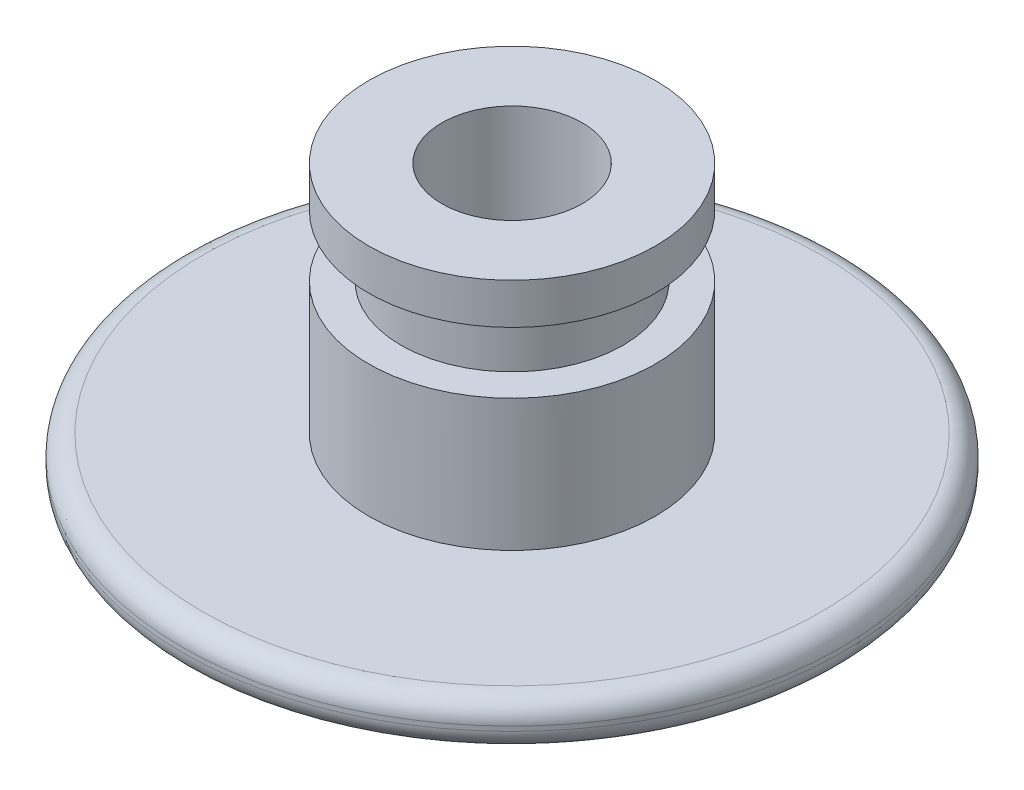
ISO-10303-21;
HEADER;
FILE_DESCRIPTION(('STEP AP214'),'2;1');
FILE_NAME('part.step','',(''),(''),'','','');
FILE_SCHEMA(('AUTOMOTIVE_DESIGN { 1 0 10303 214 1 1 1 1 }'));
ENDSEC;
DATA;
#1=APPLICATION_CONTEXT('core data for automotive mechanical design processes');
#2=APPLICATION_PROTOCOL_DEFINITION('international standard','automotive_design',2000,#1);
#3=PRODUCT_CONTEXT('',#1,'mechanical');
#4=PRODUCT('Part','Part','',(#3));
#5=PRODUCT_RELATED_PRODUCT_CATEGORY('part','',(#4));
#6=PRODUCT_DEFINITION_FORMATION('','',#4);
#7=PRODUCT_DEFINITION_CONTEXT('part definition',#1,'design');
#8=PRODUCT_DEFINITION('design','',#6,#7);
#9=PRODUCT_DEFINITION_SHAPE('','',#8);
#10=(LENGTH_UNIT() NAMED_UNIT(*) SI_UNIT(.MILLI.,.METRE.));
#11=(NAMED_UNIT(*) PLANE_ANGLE_UNIT() SI_UNIT($,.RADIAN.));
#12=(NAMED_UNIT(*) SI_UNIT($,.STERADIAN.) SOLID_ANGLE_UNIT());
#13=UNCERTAINTY_MEASURE_WITH_UNIT(LENGTH_MEASURE(1.E-05),#10,'distance_accuracy_value','');
#14=(GEOMETRIC_REPRESENTATION_CONTEXT(3) GLOBAL_UNCERTAINTY_ASSIGNED_CONTEXT((#13)) GLOBAL_UNIT_ASSIGNED_CONTEXT((#10,
#11,#12)) REPRESENTATION_CONTEXT('',''));
#15=CARTESIAN_POINT('',(0.,0.,0.));
#16=DIRECTION('',(0.,0.,1.));
#17=DIRECTION('',(1.,0.,0.));
#18=AXIS2_PLACEMENT_3D('',#15,#16,#17);
#19=CARTESIAN_POINT('',(0.,10.7696,0.));
#20=DIRECTION('',(0.,-1.,0.));
#21=DIRECTION('',(0.,0.,-1.));
#22=AXIS2_PLACEMENT_3D('',#19,#20,#21);
#23=CYLINDRICAL_SURFACE('',#22,5.5245);
#24=CARTESIAN_POINT('',(0.,10.7696,0.));
#25=DIRECTION('',(0.,1.,0.));
#26=DIRECTION('',(0.,0.,1.));
#27=AXIS2_PLACEMENT_3D('',#24,#25,#26);
#28=CIRCLE('',#27,5.5245);
#29=CARTESIAN_POINT('',(0.,10.7696,5.5245));
#30=VERTEX_POINT('',#29);
#31=EDGE_CURVE('E64',#30,#30,#28,.T.);
#32=ORIENTED_EDGE('',*,*,#31,.F.);
#33=EDGE_LOOP('',(#32));
#34=FACE_BOUND('',#33,.T.);
#35=CARTESIAN_POINT('',(0.,9.1948,0.));
#36=DIRECTION('',(0.,-1.,0.));
#37=DIRECTION('',(0.,0.,-1.));
#38=AXIS2_PLACEMENT_3D('',#35,#36,#37);
#39=CIRCLE('',#38,5.5245);
#40=CARTESIAN_POINT('',(0.,9.1948,-5.5245));
#41=VERTEX_POINT('',#40);
#42=EDGE_CURVE('E54',#41,#41,#39,.T.);
#43=ORIENTED_EDGE('',*,*,#42,.F.);
#44=EDGE_LOOP('',(#43));
#45=FACE_BOUND('',#44,.T.);
#46=ADVANCED_FACE('F33',(#34,#45),#23,.T.);
#47=CARTESIAN_POINT('',(0.,1.7526,0.));
#48=DIRECTION('',(0.,1.,0.));
#49=DIRECTION('',(0.,0.,1.));
#50=AXIS2_PLACEMENT_3D('',#47,#48,#49);
#51=PLANE('',#50);
#52=CARTESIAN_POINT('',(0.,1.7526,0.));
#53=DIRECTION('',(0.,1.,0.));
#54=DIRECTION('',(0.,0.,1.));
#55=AXIS2_PLACEMENT_3D('',#52,#53,#54);
#56=CIRCLE('',#55,11.9126);
#57=CARTESIAN_POINT('',(0.,1.7526,11.9126));
#58=VERTEX_POINT('',#57);
#59=EDGE_CURVE('E48',#58,#58,#56,.T.);
#60=ORIENTED_EDGE('',*,*,#59,.T.);
#61=EDGE_LOOP('',(#60));
#62=FACE_BOUND('',#61,.T.);
#63=CARTESIAN_POINT('',(0.,1.7526,0.));
#64=DIRECTION('',(0.,1.,0.));
#65=DIRECTION('',(0.,0.,1.));
#66=AXIS2_PLACEMENT_3D('',#63,#64,#65);
#67=CIRCLE('',#66,5.5245);
#68=CARTESIAN_POINT('',(0.,1.7526,5.5245));
#69=VERTEX_POINT('',#68);
#70=EDGE_CURVE('E67',#69,#69,#67,.T.);
#71=ORIENTED_EDGE('',*,*,#70,.F.);
#72=EDGE_LOOP('',(#71));
#73=FACE_BOUND('',#72,.T.);
#74=ADVANCED_FACE('F102',(#62,#73),#51,.T.);
#75=CARTESIAN_POINT('',(0.,1.7526,0.));
#76=DIRECTION('',(0.,-1.,0.));
#77=DIRECTION('',(0.,0.,-1.));
#78=AXIS2_PLACEMENT_3D('',#75,#76,#77);
#79=CYLINDRICAL_SURFACE('',#78,12.7);
#80=CARTESIAN_POINT('',(0.,0.9652,0.));
#81=DIRECTION('',(0.,1.,0.));
#82=DIRECTION('',(0.,0.,1.));
#83=AXIS2_PLACEMENT_3D('',#80,#81,#82);
#84=CIRCLE('',#83,12.7);
#85=CARTESIAN_POINT('',(0.,0.9652,12.7));
#86=VERTEX_POINT('',#85);
#87=EDGE_CURVE('E40',#86,#86,#84,.F.);
#88=ORIENTED_EDGE('',*,*,#87,.T.);
#89=EDGE_LOOP('',(#88));
#90=FACE_BOUND('',#89,.T.);
#91=CARTESIAN_POINT('',(0.,0.7874,0.));
#92=DIRECTION('',(0.,1.,0.));
#93=DIRECTION('',(0.,0.,1.));
#94=AXIS2_PLACEMENT_3D('',#91,#92,#93);
#95=CIRCLE('',#94,12.7);
#96=CARTESIAN_POINT('',(0.,0.7874,12.7));
#97=VERTEX_POINT('',#96);
#98=EDGE_CURVE('E44',#97,#97,#95,.T.);
#99=ORIENTED_EDGE('',*,*,#98,.T.);
#100=EDGE_LOOP('',(#99));
#101=FACE_BOUND('',#100,.T.);
#102=ADVANCED_FACE('F35',(#90,#101),#79,.T.);
#103=CARTESIAN_POINT('',(0.,0.,0.));
#104=DIRECTION('',(0.,1.,0.));
#105=DIRECTION('',(0.,0.,1.));
#106=AXIS2_PLACEMENT_3D('',#103,#104,#105);
#107=PLANE('',#106);
#108=CARTESIAN_POINT('',(0.,0.,0.));
#109=DIRECTION('',(0.,1.,0.));
#110=DIRECTION('',(0.,0.,1.));
#111=AXIS2_PLACEMENT_3D('',#108,#109,#110);
#112=CIRCLE('',#111,11.9126);
#113=CARTESIAN_POINT('',(0.,0.,11.9126));
#114=VERTEX_POINT('',#113);
#115=EDGE_CURVE('E11',#114,#114,#112,.F.);
#116=ORIENTED_EDGE('',*,*,#115,.T.);
#117=EDGE_LOOP('',(#116));
#118=FACE_BOUND('',#117,.T.);
#119=CARTESIAN_POINT('',(0.,0.,0.));
#120=DIRECTION('',(0.,-1.,0.));
#121=DIRECTION('',(0.,0.,-1.));
#122=AXIS2_PLACEMENT_3D('',#119,#120,#121);
#123=CIRCLE('',#122,0.8509);
#124=CARTESIAN_POINT('',(0.,0.,-0.8509));
#125=VERTEX_POINT('',#124);
#126=EDGE_CURVE('E57',#125,#125,#123,.T.);
#127=ORIENTED_EDGE('',*,*,#126,.F.);
#128=EDGE_LOOP('',(#127));
#129=FACE_BOUND('',#128,.T.);
#130=ADVANCED_FACE('F116',(#118,#129),#107,.F.);
#131=CARTESIAN_POINT('',(0.,6.8326,0.));
#132=DIRECTION('',(0.,-1.,0.));
#133=DIRECTION('',(0.,0.,-1.));
#134=AXIS2_PLACEMENT_3D('',#131,#132,#133);
#135=CIRCLE('',#134,5.5245);
#136=CARTESIAN_POINT('',(0.,6.8326,-5.5245));
#137=VERTEX_POINT('',#136);
#138=EDGE_CURVE('E58',#137,#137,#135,.T.);
#139=ORIENTED_EDGE('',*,*,#138,.T.);
#140=EDGE_LOOP('',(#139));
#141=FACE_BOUND('',#140,.T.);
#142=ORIENTED_EDGE('',*,*,#70,.T.);
#143=EDGE_LOOP('',(#142));
#144=FACE_BOUND('',#143,.T.);
#145=ADVANCED_FACE('F105',(#141,#144),#23,.T.);
#146=CARTESIAN_POINT('',(0.,10.7696,0.));
#147=DIRECTION('',(0.,1.,0.));
#148=DIRECTION('',(0.,0.,1.));
#149=AXIS2_PLACEMENT_3D('',#146,#147,#148);
#150=PLANE('',#149);
#151=CARTESIAN_POINT('',(0.,10.7696,0.));
#152=DIRECTION('',(0.,1.,0.));
#153=DIRECTION('',(0.,0.,1.));
#154=AXIS2_PLACEMENT_3D('',#151,#152,#153);
#155=CIRCLE('',#154,2.7051);
#156=CARTESIAN_POINT('',(0.,10.7696,2.7051));
#157=VERTEX_POINT('',#156);
#158=EDGE_CURVE('E73',#157,#157,#155,.T.);
#159=ORIENTED_EDGE('',*,*,#158,.F.);
#160=EDGE_LOOP('',(#159));
#161=FACE_BOUND('',#160,.T.);
#162=ORIENTED_EDGE('',*,*,#31,.T.);
#163=EDGE_LOOP('',(#162));
#164=FACE_BOUND('',#163,.T.);
#165=ADVANCED_FACE('F115',(#161,#164),#150,.T.);
#166=CARTESIAN_POINT('',(0.,2.3876,0.));
#167=DIRECTION('',(0.,1.,0.));
#168=DIRECTION('',(0.,0.,1.));
#169=AXIS2_PLACEMENT_3D('',#166,#167,#168);
#170=CYLINDRICAL_SURFACE('',#169,2.7051);
#171=CARTESIAN_POINT('',(0.,2.3876,0.));
#172=DIRECTION('',(0.,1.,0.));
#173=DIRECTION('',(0.,0.,1.));
#174=AXIS2_PLACEMENT_3D('',#171,#172,#173);
#175=CIRCLE('',#174,2.7051);
#176=CARTESIAN_POINT('',(0.,2.3876,2.7051));
#177=VERTEX_POINT('',#176);
#178=EDGE_CURVE('E70',#177,#177,#175,.T.);
#179=CARTESIAN_POINT('',(0.,2.3876,2.7051));
#180=CARTESIAN_POINT('',(0.,2.4749125,2.7051));
#181=CARTESIAN_POINT('',(0.,2.562225,2.7051));
#182=CARTESIAN_POINT('',(0.,2.73685,2.7051));
#183=CARTESIAN_POINT('',(0.,2.8241625,2.7051));
#184=CARTESIAN_POINT('',(0.,2.9987875,2.7051));
#185=CARTESIAN_POINT('',(0.,3.0861,2.7051));
#186=CARTESIAN_POINT('',(0.,3.260725,2.7051));
#187=CARTESIAN_POINT('',(0.,3.3480375,2.7051));
#188=CARTESIAN_POINT('',(0.,3.5226625,2.7051));
#189=CARTESIAN_POINT('',(0.,3.609975,2.7051));
#190=CARTESIAN_POINT('',(0.,3.7846,2.7051));
#191=CARTESIAN_POINT('',(0.,3.8719125,2.7051));
#192=CARTESIAN_POINT('',(0.,4.0465375,2.7051));
#193=CARTESIAN_POINT('',(0.,4.13385,2.7051));
#194=CARTESIAN_POINT('',(0.,4.308475,2.7051));
#195=CARTESIAN_POINT('',(0.,4.3957875,2.7051));
#196=CARTESIAN_POINT('',(0.,4.5704125,2.7051));
#197=CARTESIAN_POINT('',(0.,4.657725,2.7051));
#198=CARTESIAN_POINT('',(0.,4.83235,2.7051));
#199=CARTESIAN_POINT('',(0.,4.9196625,2.7051));
#200=CARTESIAN_POINT('',(0.,5.0942875,2.7051));
#201=CARTESIAN_POINT('',(0.,5.1816,2.7051));
#202=CARTESIAN_POINT('',(0.,5.356225,2.7051));
#203=CARTESIAN_POINT('',(0.,5.4435375,2.7051));
#204=CARTESIAN_POINT('',(0.,5.6181625,2.7051));
#205=CARTESIAN_POINT('',(0.,5.705475,2.7051));
#206=CARTESIAN_POINT('',(0.,5.8801,2.7051));
#207=CARTESIAN_POINT('',(0.,5.9674125,2.7051));
#208=CARTESIAN_POINT('',(0.,6.1420375,2.7051));
#209=CARTESIAN_POINT('',(0.,6.22935,2.7051));
#210=CARTESIAN_POINT('',(0.,6.403975,2.7051));
#211=CARTESIAN_POINT('',(0.,6.4912875,2.7051));
#212=CARTESIAN_POINT('',(0.,6.6659125,2.7051));
#213=CARTESIAN_POINT('',(0.,6.753225,2.7051));
#214=CARTESIAN_POINT('',(0.,6.92785,2.7051));
#215=CARTESIAN_POINT('',(0.,7.0151625,2.7051));
#216=CARTESIAN_POINT('',(0.,7.1897875,2.7051));
#217=CARTESIAN_POINT('',(0.,7.2771,2.7051));
#218=CARTESIAN_POINT('',(0.,7.451725,2.7051));
#219=CARTESIAN_POINT('',(0.,7.5390375,2.7051));
#220=CARTESIAN_POINT('',(0.,7.7136625,2.7051));
#221=CARTESIAN_POINT('',(0.,7.800975,2.7051));
#222=CARTESIAN_POINT('',(0.,7.9756,2.7051));
#223=CARTESIAN_POINT('',(0.,8.0629125,2.7051));
#224=CARTESIAN_POINT('',(0.,8.2375375,2.7051));
#225=CARTESIAN_POINT('',(0.,8.32485,2.7051));
#226=CARTESIAN_POINT('',(0.,8.499475,2.7051));
#227=CARTESIAN_POINT('',(0.,8.5867875,2.7051));
#228=CARTESIAN_POINT('',(0.,8.7614125,2.7051));
#229=CARTESIAN_POINT('',(0.,8.848725,2.7051));
#230=CARTESIAN_POINT('',(0.,9.02335,2.7051));
#231=CARTESIAN_POINT('',(0.,9.1106625,2.7051));
#232=CARTESIAN_POINT('',(0.,9.2852875,2.7051));
#233=CARTESIAN_POINT('',(0.,9.3726,2.7051));
#234=CARTESIAN_POINT('',(0.,9.547225,2.7051));
#235=CARTESIAN_POINT('',(0.,9.6345375,2.7051));
#236=CARTESIAN_POINT('',(0.,9.8091625,2.7051));
#237=CARTESIAN_POINT('',(0.,9.896475,2.7051));
#238=CARTESIAN_POINT('',(0.,10.0711,2.7051));
#239=CARTESIAN_POINT('',(0.,10.1584125,2.7051));
#240=CARTESIAN_POINT('',(0.,10.3330375,2.7051));
#241=CARTESIAN_POINT('',(0.,10.42035,2.7051));
#242=CARTESIAN_POINT('',(0.,10.594975,2.7051));
#243=CARTESIAN_POINT('',(0.,10.6822875,2.7051));
#244=CARTESIAN_POINT('',(0.,10.7696,2.7051));
#245=B_SPLINE_CURVE_WITH_KNOTS('',3,(#179,#180,#181,#182,#183,#184,#185,#186,#187,#188,#189,
#190,#191,#192,#193,#194,#195,#196,#197,#198,#199,#200,#201,#202,#203,#204,#205,#206,#207,#208,
#209,#210,#211,#212,#213,#214,#215,#216,#217,#218,#219,#220,#221,#222,#223,#224,#225,#226,#227,
#228,#229,#230,#231,#232,#233,#234,#235,#236,#237,#238,#239,#240,#241,#242,#243,#244),
.UNSPECIFIED.,.F.,.F.,(4,2,2,2,2,2,2,2,2,2,2,2,2,2,2,2,2,2,2,2,2,2,2,2,2,2,2,2,2,2,2,2,4),(0.,
0.2619375,0.523875,0.7858125,1.04775,1.3096875,1.571625,1.8335625,2.0955,2.3574375,2.619375,
2.8813125,3.14325,3.4051875,3.667125,3.9290625,4.191,4.4529375,4.714875,4.9768125,5.23875,
5.5006875,5.762625,6.0245625,6.2865,6.5484375,6.810375,7.0723125,7.33425,7.5961875,7.858125,
8.1200625,8.382),.UNSPECIFIED.);
#246=EDGE_CURVE('BSEAM122',#177,#157,#245,.T.);
#247=ORIENTED_EDGE('',*,*,#178,.F.);
#248=ORIENTED_EDGE('',*,*,#158,.T.);
#249=ORIENTED_EDGE('',*,*,#246,.T.);
#250=ORIENTED_EDGE('',*,*,#246,.F.);
#251=EDGE_LOOP('',(#247,#249,#248,#250));
#252=FACE_BOUND('',#251,.T.);
#253=ADVANCED_FACE('F122',(#252),#170,.F.);
#254=CARTESIAN_POINT('',(0.,10.7696,0.));
#255=DIRECTION('',(0.,-1.,0.));
#256=DIRECTION('',(0.,0.,-1.));
#257=AXIS2_PLACEMENT_3D('',#254,#255,#256);
#258=CYLINDRICAL_SURFACE('',#257,0.8509);
#259=CARTESIAN_POINT('',(0.,0.533399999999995,0.));
#260=DIRECTION('',(0.,1.,0.));
#261=DIRECTION('',(0.,0.,1.));
#262=AXIS2_PLACEMENT_3D('',#259,#260,#261);
#263=CIRCLE('',#262,0.8509);
#264=CARTESIAN_POINT('',(0.,0.533399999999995,0.8509));
#265=VERTEX_POINT('',#264);
#266=EDGE_CURVE('E53',#265,#265,#263,.T.);
#267=ORIENTED_EDGE('',*,*,#266,.T.);
#268=EDGE_LOOP('',(#267));
#269=FACE_BOUND('',#268,.T.);
#270=ORIENTED_EDGE('',*,*,#126,.T.);
#271=EDGE_LOOP('',(#270));
#272=FACE_BOUND('',#271,.T.);
#273=ADVANCED_FACE('F134',(#269,#272),#258,.F.);
#274=CARTESIAN_POINT('',(0.,0.533399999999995,0.));
#275=DIRECTION('',(0.,1.,0.));
#276=DIRECTION('',(0.,0.,1.));
#277=AXIS2_PLACEMENT_3D('',#274,#275,#276);
#278=CONICAL_SURFACE('',#277,0.8509,0.785398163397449);
#279=CARTESIAN_POINT('',(0.,2.3876,2.70510000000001));
#280=CARTESIAN_POINT('',(0.,2.36828541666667,2.68578541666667));
#281=CARTESIAN_POINT('',(0.,2.34897083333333,2.66647083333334));
#282=CARTESIAN_POINT('',(0.,2.31034166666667,2.62784166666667));
#283=CARTESIAN_POINT('',(0.,2.29102708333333,2.60852708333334));
#284=CARTESIAN_POINT('',(0.,2.25239791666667,2.56989791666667));
#285=CARTESIAN_POINT('',(0.,2.23308333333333,2.55058333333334));
#286=CARTESIAN_POINT('',(0.,2.19445416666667,2.51195416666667));
#287=CARTESIAN_POINT('',(0.,2.17513958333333,2.49263958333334));
#288=CARTESIAN_POINT('',(0.,2.13651041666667,2.45401041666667));
#289=CARTESIAN_POINT('',(0.,2.11719583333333,2.43469583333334));
#290=CARTESIAN_POINT('',(0.,2.07856666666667,2.39606666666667));
#291=CARTESIAN_POINT('',(0.,2.05925208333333,2.37675208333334));
#292=CARTESIAN_POINT('',(0.,2.02062291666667,2.33812291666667));
#293=CARTESIAN_POINT('',(0.,2.00130833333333,2.31880833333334));
#294=CARTESIAN_POINT('',(0.,1.96267916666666,2.28017916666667));
#295=CARTESIAN_POINT('',(0.,1.94336458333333,2.26086458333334));
#296=CARTESIAN_POINT('',(0.,1.90473541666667,2.22223541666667));
#297=CARTESIAN_POINT('',(0.,1.88542083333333,2.20292083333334));
#298=CARTESIAN_POINT('',(0.,1.84679166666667,2.16429166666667));
#299=CARTESIAN_POINT('',(0.,1.82747708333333,2.14497708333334));
#300=CARTESIAN_POINT('',(0.,1.78884791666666,2.10634791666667));
#301=CARTESIAN_POINT('',(0.,1.76953333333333,2.08703333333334));
#302=CARTESIAN_POINT('',(0.,1.73090416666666,2.04840416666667));
#303=CARTESIAN_POINT('',(0.,1.71158958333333,2.02908958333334));
#304=CARTESIAN_POINT('',(0.,1.67296041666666,1.99046041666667));
#305=CARTESIAN_POINT('',(0.,1.65364583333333,1.97114583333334));
#306=CARTESIAN_POINT('',(0.,1.61501666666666,1.93251666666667));
#307=CARTESIAN_POINT('',(0.,1.59570208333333,1.91320208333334));
#308=CARTESIAN_POINT('',(0.,1.55707291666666,1.87457291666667));
#309=CARTESIAN_POINT('',(0.,1.53775833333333,1.85525833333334));
#310=CARTESIAN_POINT('',(0.,1.49912916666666,1.81662916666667));
#311=CARTESIAN_POINT('',(0.,1.47981458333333,1.79731458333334));
#312=CARTESIAN_POINT('',(0.,1.44118541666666,1.75868541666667));
#313=CARTESIAN_POINT('',(0.,1.42187083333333,1.73937083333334));
#314=CARTESIAN_POINT('',(0.,1.38324166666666,1.70074166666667));
#315=CARTESIAN_POINT('',(0.,1.36392708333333,1.68142708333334));
#316=CARTESIAN_POINT('',(0.,1.32529791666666,1.64279791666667));
#317=CARTESIAN_POINT('',(0.,1.30598333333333,1.62348333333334));
#318=CARTESIAN_POINT('',(0.,1.26735416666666,1.58485416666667));
#319=CARTESIAN_POINT('',(0.,1.24803958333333,1.56553958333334));
#320=CARTESIAN_POINT('',(0.,1.20941041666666,1.52691041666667));
#321=CARTESIAN_POINT('',(0.,1.19009583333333,1.50759583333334));
#322=CARTESIAN_POINT('',(0.,1.15146666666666,1.46896666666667));
#323=CARTESIAN_POINT('',(0.,1.13215208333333,1.44965208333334));
#324=CARTESIAN_POINT('',(0.,1.09352291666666,1.41102291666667));
#325=CARTESIAN_POINT('',(0.,1.07420833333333,1.39170833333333));
#326=CARTESIAN_POINT('',(0.,1.03557916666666,1.35307916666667));
#327=CARTESIAN_POINT('',(0.,1.01626458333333,1.33376458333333));
#328=CARTESIAN_POINT('',(0.,0.977635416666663,1.29513541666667));
#329=CARTESIAN_POINT('',(0.,0.958320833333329,1.27582083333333));
#330=CARTESIAN_POINT('',(0.,0.919691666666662,1.23719166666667));
#331=CARTESIAN_POINT('',(0.,0.900377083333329,1.21787708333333));
#332=CARTESIAN_POINT('',(0.,0.861747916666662,1.17924791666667));
#333=CARTESIAN_POINT('',(0.,0.842433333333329,1.15993333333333));
#334=CARTESIAN_POINT('',(0.,0.803804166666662,1.12130416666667));
#335=CARTESIAN_POINT('',(0.,0.784489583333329,1.10198958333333));
#336=CARTESIAN_POINT('',(0.,0.745860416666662,1.06336041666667));
#337=CARTESIAN_POINT('',(0.,0.726545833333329,1.04404583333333));
#338=CARTESIAN_POINT('',(0.,0.687916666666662,1.00541666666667));
#339=CARTESIAN_POINT('',(0.,0.668602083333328,0.986102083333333));
#340=CARTESIAN_POINT('',(0.,0.629972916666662,0.947472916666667));
#341=CARTESIAN_POINT('',(0.,0.610658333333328,0.928158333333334));
#342=CARTESIAN_POINT('',(0.,0.572029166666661,0.889529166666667));
#343=CARTESIAN_POINT('',(0.,0.552714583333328,0.870214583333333));
#344=CARTESIAN_POINT('',(0.,0.533399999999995,0.8509));
#345=B_SPLINE_CURVE_WITH_KNOTS('',3,(#279,#280,#281,#282,#283,#284,#285,#286,#287,#288,#289,
#290,#291,#292,#293,#294,#295,#296,#297,#298,#299,#300,#301,#302,#303,#304,#305,#306,#307,#308,
#309,#310,#311,#312,#313,#314,#315,#316,#317,#318,#319,#320,#321,#322,#323,#324,#325,#326,#327,
#328,#329,#330,#331,#332,#333,#334,#335,#336,#337,#338,#339,#340,#341,#342,#343,#344),
.UNSPECIFIED.,.F.,.F.,(4,2,2,2,2,2,2,2,2,2,2,2,2,2,2,2,2,2,2,2,2,2,2,2,2,2,2,2,2,2,2,2,4),(0.,
0.0819448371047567,0.163889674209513,0.245834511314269,0.327779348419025,0.409724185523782,
0.491669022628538,0.573613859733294,0.65555869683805,0.737503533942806,0.819448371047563,
0.901393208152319,0.983338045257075,1.06528288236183,1.14722771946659,1.22917255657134,
1.3111173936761,1.39306223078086,1.47500706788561,1.55695190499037,1.63889674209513,
1.72084157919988,1.80278641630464,1.88473125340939,1.96667609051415,2.04862092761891,
2.13056576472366,2.21251060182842,2.29445543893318,2.37640027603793,2.45834511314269,
2.54028995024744,2.6222347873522),.UNSPECIFIED.);
#346=EDGE_CURVE('BSEAM136',#177,#265,#345,.T.);
#347=ORIENTED_EDGE('',*,*,#178,.T.);
#348=ORIENTED_EDGE('',*,*,#266,.F.);
#349=ORIENTED_EDGE('',*,*,#346,.T.);
#350=ORIENTED_EDGE('',*,*,#346,.F.);
#351=EDGE_LOOP('',(#347,#349,#348,#350));
#352=FACE_BOUND('',#351,.T.);
#353=ADVANCED_FACE('F136',(#352),#278,.F.);
#354=CARTESIAN_POINT('',(0.,9.1948,0.));
#355=DIRECTION('',(0.,-1.,0.));
#356=DIRECTION('',(0.,0.,-1.));
#357=AXIS2_PLACEMENT_3D('',#354,#355,#356);
#358=PLANE('',#357);
#359=CARTESIAN_POINT('',(0.,9.1948,0.));
#360=DIRECTION('',(0.,-1.,0.));
#361=DIRECTION('',(0.,0.,-1.));
#362=AXIS2_PLACEMENT_3D('',#359,#360,#361);
#363=CIRCLE('',#362,4.2799);
#364=CARTESIAN_POINT('',(0.,9.1948,-4.2799));
#365=VERTEX_POINT('',#364);
#366=EDGE_CURVE('E61',#365,#365,#363,.T.);
#367=ORIENTED_EDGE('',*,*,#366,.F.);
#368=EDGE_LOOP('',(#367));
#369=FACE_BOUND('',#368,.T.);
#370=ORIENTED_EDGE('',*,*,#42,.T.);
#371=EDGE_LOOP('',(#370));
#372=FACE_BOUND('',#371,.T.);
#373=ADVANCED_FACE('F99',(#369,#372),#358,.T.);
#374=CARTESIAN_POINT('',(0.,6.8326,0.));
#375=DIRECTION('',(0.,-1.,0.));
#376=DIRECTION('',(0.,0.,-1.));
#377=AXIS2_PLACEMENT_3D('',#374,#375,#376);
#378=PLANE('',#377);
#379=CARTESIAN_POINT('',(0.,6.8326,0.));
#380=DIRECTION('',(0.,-1.,0.));
#381=DIRECTION('',(0.,0.,-1.));
#382=AXIS2_PLACEMENT_3D('',#379,#380,#381);
#383=CIRCLE('',#382,4.2799);
#384=CARTESIAN_POINT('',(0.,6.8326,-4.2799));
#385=VERTEX_POINT('',#384);
#386=EDGE_CURVE('E80',#385,#385,#383,.T.);
#387=ORIENTED_EDGE('',*,*,#386,.T.);
#388=EDGE_LOOP('',(#387));
#389=FACE_BOUND('',#388,.T.);
#390=ORIENTED_EDGE('',*,*,#138,.F.);
#391=EDGE_LOOP('',(#390));
#392=FACE_BOUND('',#391,.T.);
#393=ADVANCED_FACE('F84',(#389,#392),#378,.F.);
#394=CARTESIAN_POINT('',(0.,9.1948,0.));
#395=DIRECTION('',(0.,-1.,0.));
#396=DIRECTION('',(0.,0.,-1.));
#397=AXIS2_PLACEMENT_3D('',#394,#395,#396);
#398=CYLINDRICAL_SURFACE('',#397,4.2799);
#399=ORIENTED_EDGE('',*,*,#366,.T.);
#400=EDGE_LOOP('',(#399));
#401=FACE_BOUND('',#400,.T.);
#402=ORIENTED_EDGE('',*,*,#386,.F.);
#403=EDGE_LOOP('',(#402));
#404=FACE_BOUND('',#403,.T.);
#405=ADVANCED_FACE('F87',(#401,#404),#398,.T.);
#406=CARTESIAN_POINT('',(0.,0.9652,0.));
#407=DIRECTION('',(0.,1.,0.));
#408=DIRECTION('',(0.,0.,1.));
#409=AXIS2_PLACEMENT_3D('',#406,#407,#408);
#410=TOROIDAL_SURFACE('',#409,11.9126,0.7874);
#411=ORIENTED_EDGE('',*,*,#87,.F.);
#412=EDGE_LOOP('',(#411));
#413=FACE_BOUND('',#412,.T.);
#414=ORIENTED_EDGE('',*,*,#59,.F.);
#415=EDGE_LOOP('',(#414));
#416=FACE_BOUND('',#415,.T.);
#417=ADVANCED_FACE('F89',(#413,#416),#410,.T.);
#418=CARTESIAN_POINT('',(0.,0.7874,0.));
#419=DIRECTION('',(0.,1.,0.));
#420=DIRECTION('',(0.,0.,1.));
#421=AXIS2_PLACEMENT_3D('',#418,#419,#420);
#422=TOROIDAL_SURFACE('',#421,11.9126,0.7874);
#423=ORIENTED_EDGE('',*,*,#115,.F.);
#424=EDGE_LOOP('',(#423));
#425=FACE_BOUND('',#424,.T.);
#426=ORIENTED_EDGE('',*,*,#98,.F.);
#427=EDGE_LOOP('',(#426));
#428=FACE_BOUND('',#427,.T.);
#429=ADVANCED_FACE('F96',(#425,#428),#422,.T.);
#430=CLOSED_SHELL('',(#46,#74,#102,#130,#145,#165,#253,#273,#353,#373,#393,#405,#417,#429));
#431=MANIFOLD_SOLID_BREP('B2',#430);
#432=ADVANCED_BREP_SHAPE_REPRESENTATION('',(#18,#431),#14);
#433=SHAPE_DEFINITION_REPRESENTATION(#9,#432);
ENDSEC;
END-ISO-10303-21;
